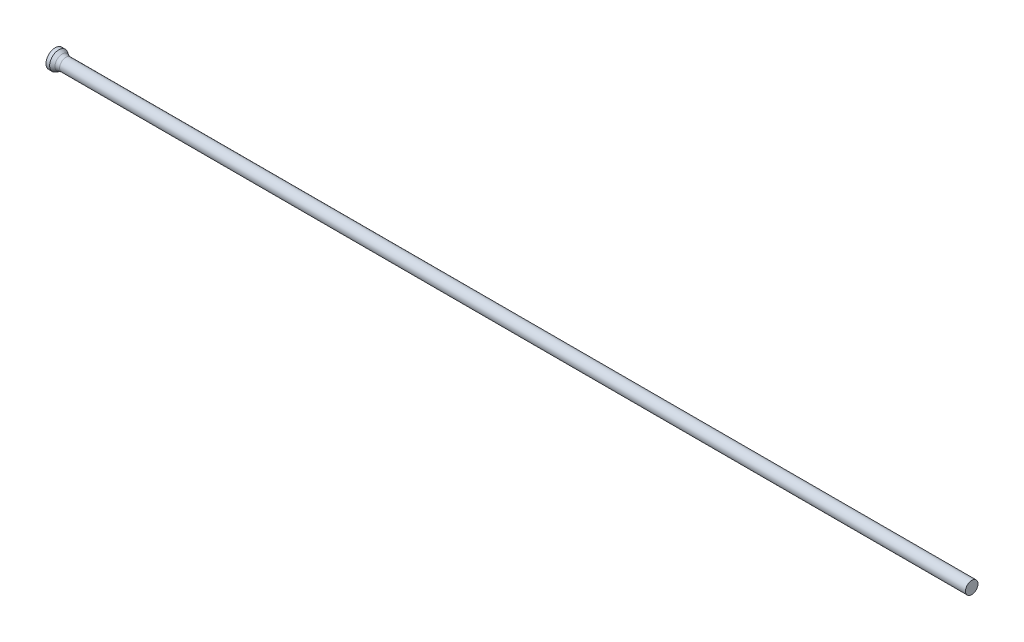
ISO-10303-21;
HEADER;
FILE_DESCRIPTION(('STEP AP214'),'2;1');
FILE_NAME('part.step','',(''),(''),'','','');
FILE_SCHEMA(('AUTOMOTIVE_DESIGN { 1 0 10303 214 1 1 1 1 }'));
ENDSEC;
DATA;
#1=APPLICATION_CONTEXT('core data for automotive mechanical design processes');
#2=APPLICATION_PROTOCOL_DEFINITION('international standard','automotive_design',2000,#1);
#3=PRODUCT_CONTEXT('',#1,'mechanical');
#4=PRODUCT('Part','Part','',(#3));
#5=PRODUCT_RELATED_PRODUCT_CATEGORY('part','',(#4));
#6=PRODUCT_DEFINITION_FORMATION('','',#4);
#7=PRODUCT_DEFINITION_CONTEXT('part definition',#1,'design');
#8=PRODUCT_DEFINITION('design','',#6,#7);
#9=PRODUCT_DEFINITION_SHAPE('','',#8);
#10=(LENGTH_UNIT() NAMED_UNIT(*) SI_UNIT(.MILLI.,.METRE.));
#11=(NAMED_UNIT(*) PLANE_ANGLE_UNIT() SI_UNIT($,.RADIAN.));
#12=(NAMED_UNIT(*) SI_UNIT($,.STERADIAN.) SOLID_ANGLE_UNIT());
#13=UNCERTAINTY_MEASURE_WITH_UNIT(LENGTH_MEASURE(1.E-05),#10,'distance_accuracy_value','');
#14=(GEOMETRIC_REPRESENTATION_CONTEXT(3) GLOBAL_UNCERTAINTY_ASSIGNED_CONTEXT((#13)) GLOBAL_UNIT_ASSIGNED_CONTEXT((#10,
#11,#12)) REPRESENTATION_CONTEXT('',''));
#15=CARTESIAN_POINT('',(0.,0.,0.));
#16=DIRECTION('',(0.,0.,1.));
#17=DIRECTION('',(1.,0.,0.));
#18=AXIS2_PLACEMENT_3D('',#15,#16,#17);
#19=CARTESIAN_POINT('',(0.,0.,0.));
#20=DIRECTION('',(1.,0.,0.));
#21=DIRECTION('',(0.,0.,-1.));
#22=AXIS2_PLACEMENT_3D('',#19,#20,#21);
#23=PLANE('',#22);
#24=CARTESIAN_POINT('',(0.,0.,0.));
#25=DIRECTION('',(-1.,0.,0.));
#26=DIRECTION('',(0.,0.,1.));
#27=AXIS2_PLACEMENT_3D('',#24,#25,#26);
#28=CIRCLE('',#27,1.25);
#29=CARTESIAN_POINT('',(0.,0.,1.25));
#30=VERTEX_POINT('',#29);
#31=EDGE_CURVE('E25',#30,#30,#28,.T.);
#32=ORIENTED_EDGE('',*,*,#31,.T.);
#33=EDGE_LOOP('',(#32));
#34=FACE_BOUND('',#33,.T.);
#35=ADVANCED_FACE('F14',(#34),#23,.F.);
#36=CARTESIAN_POINT('',(0.,0.,0.));
#37=DIRECTION('',(-1.,0.,0.));
#38=DIRECTION('',(0.,0.,1.));
#39=AXIS2_PLACEMENT_3D('',#36,#37,#38);
#40=CYLINDRICAL_SURFACE('',#39,1.25);
#41=ORIENTED_EDGE('',*,*,#31,.F.);
#42=EDGE_LOOP('',(#41));
#43=FACE_BOUND('',#42,.T.);
#44=CARTESIAN_POINT('',(0.497179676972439,0.,0.));
#45=DIRECTION('',(-1.,0.,0.));
#46=DIRECTION('',(0.,0.,1.));
#47=AXIS2_PLACEMENT_3D('',#44,#45,#46);
#48=CIRCLE('',#47,1.25);
#49=CARTESIAN_POINT('',(0.497179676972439,0.,1.25));
#50=VERTEX_POINT('',#49);
#51=EDGE_CURVE('E29',#50,#50,#48,.T.);
#52=ORIENTED_EDGE('',*,*,#51,.T.);
#53=EDGE_LOOP('',(#52));
#54=FACE_BOUND('',#53,.T.);
#55=ADVANCED_FACE('F53',(#43,#54),#40,.T.);
#56=CARTESIAN_POINT('',(1.19,0.,0.));
#57=DIRECTION('',(-1.,0.,0.));
#58=DIRECTION('',(0.,0.,1.));
#59=AXIS2_PLACEMENT_3D('',#56,#57,#58);
#60=CONICAL_SURFACE('',#59,0.85,0.523598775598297);
#61=CARTESIAN_POINT('',(0.957949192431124,0.,0.));
#62=DIRECTION('',(-1.,0.,0.));
#63=DIRECTION('',(0.,0.,1.));
#64=AXIS2_PLACEMENT_3D('',#61,#62,#63);
#65=CIRCLE('',#64,0.983974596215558);
#66=CARTESIAN_POINT('',(0.957949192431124,0.,0.983974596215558));
#67=VERTEX_POINT('',#66);
#68=EDGE_CURVE('E21',#67,#67,#65,.T.);
#69=ORIENTED_EDGE('',*,*,#68,.T.);
#70=EDGE_LOOP('',(#69));
#71=FACE_BOUND('',#70,.T.);
#72=ORIENTED_EDGE('',*,*,#51,.F.);
#73=EDGE_LOOP('',(#72));
#74=FACE_BOUND('',#73,.T.);
#75=ADVANCED_FACE('F50',(#71,#74),#60,.T.);
#76=CARTESIAN_POINT('',(0.,0.,0.));
#77=DIRECTION('',(-1.,0.,0.));
#78=DIRECTION('',(0.,0.,1.));
#79=AXIS2_PLACEMENT_3D('',#76,#77,#78);
#80=CYLINDRICAL_SURFACE('',#79,0.85);
#81=CARTESIAN_POINT('',(1.45794919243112,0.,0.));
#82=DIRECTION('',(-1.,0.,0.));
#83=DIRECTION('',(0.,0.,1.));
#84=AXIS2_PLACEMENT_3D('',#81,#82,#83);
#85=CIRCLE('',#84,0.85);
#86=CARTESIAN_POINT('',(1.45794919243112,0.,0.85));
#87=VERTEX_POINT('',#86);
#88=EDGE_CURVE('E9',#87,#87,#85,.F.);
#89=ORIENTED_EDGE('',*,*,#88,.T.);
#90=EDGE_LOOP('',(#89));
#91=FACE_BOUND('',#90,.T.);
#92=CARTESIAN_POINT('',(125.,0.,0.));
#93=DIRECTION('',(-1.,0.,0.));
#94=DIRECTION('',(0.,0.,1.));
#95=AXIS2_PLACEMENT_3D('',#92,#93,#94);
#96=CIRCLE('',#95,0.85);
#97=CARTESIAN_POINT('',(125.,0.,0.85));
#98=VERTEX_POINT('',#97);
#99=EDGE_CURVE('E34',#98,#98,#96,.T.);
#100=ORIENTED_EDGE('',*,*,#99,.T.);
#101=EDGE_LOOP('',(#100));
#102=FACE_BOUND('',#101,.T.);
#103=ADVANCED_FACE('F38',(#91,#102),#80,.T.);
#104=CARTESIAN_POINT('',(125.,0.85,0.));
#105=DIRECTION('',(-1.,0.,0.));
#106=DIRECTION('',(0.,0.,1.));
#107=AXIS2_PLACEMENT_3D('',#104,#105,#106);
#108=PLANE('',#107);
#109=ORIENTED_EDGE('',*,*,#99,.F.);
#110=EDGE_LOOP('',(#109));
#111=FACE_BOUND('',#110,.T.);
#112=ADVANCED_FACE('F40',(#111),#108,.F.);
#113=CARTESIAN_POINT('',(1.45794919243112,0.,0.));
#114=DIRECTION('',(-1.,0.,0.));
#115=DIRECTION('',(0.,0.,1.));
#116=AXIS2_PLACEMENT_3D('',#113,#114,#115);
#117=TOROIDAL_SURFACE('',#116,1.85,1.);
#118=ORIENTED_EDGE('',*,*,#88,.F.);
#119=EDGE_LOOP('',(#118));
#120=FACE_BOUND('',#119,.T.);
#121=ORIENTED_EDGE('',*,*,#68,.F.);
#122=EDGE_LOOP('',(#121));
#123=FACE_BOUND('',#122,.T.);
#124=ADVANCED_FACE('F16',(#120,#123),#117,.F.);
#125=CLOSED_SHELL('',(#35,#55,#75,#103,#112,#124));
#126=MANIFOLD_SOLID_BREP('B1',#125);
#127=ADVANCED_BREP_SHAPE_REPRESENTATION('',(#18,#126),#14);
#128=SHAPE_DEFINITION_REPRESENTATION(#9,#127);
ENDSEC;
END-ISO-10303-21;
